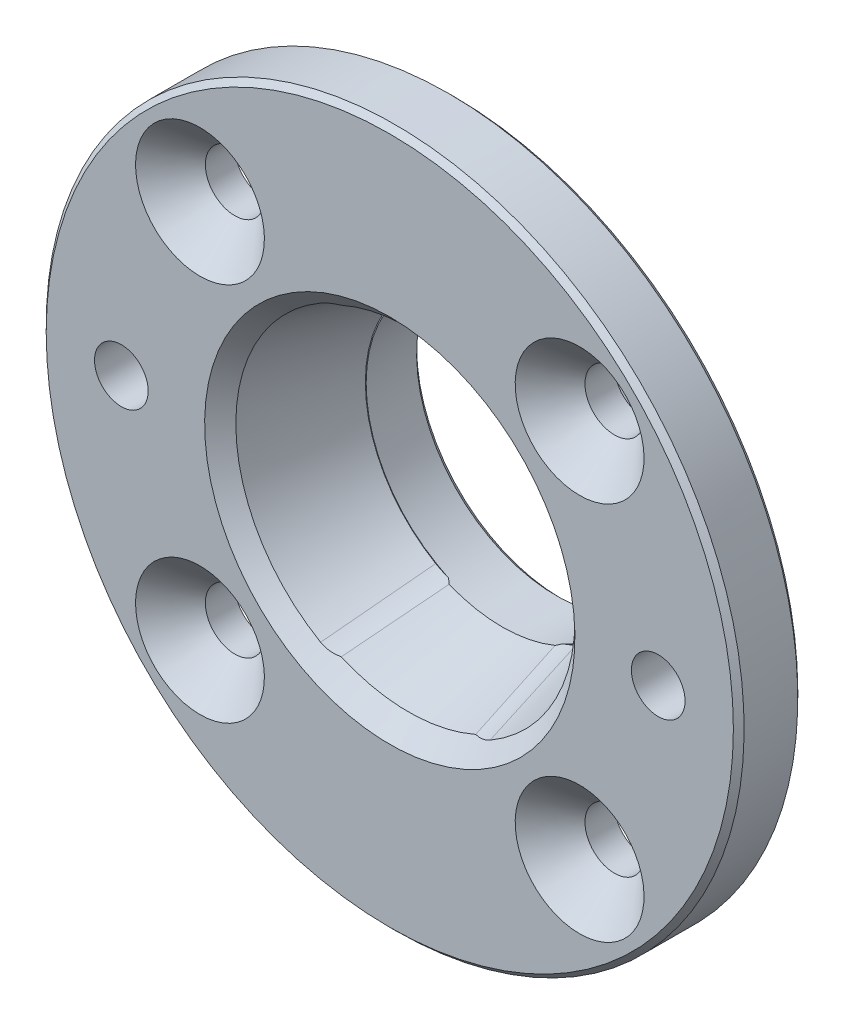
ISO-10303-21;
HEADER;
FILE_DESCRIPTION(('STEP AP214'),'2;1');
FILE_NAME('part.step','',(''),(''),'','','');
FILE_SCHEMA(('AUTOMOTIVE_DESIGN { 1 0 10303 214 1 1 1 1 }'));
ENDSEC;
DATA;
#1=APPLICATION_CONTEXT('core data for automotive mechanical design processes');
#2=APPLICATION_PROTOCOL_DEFINITION('international standard','automotive_design',2000,#1);
#3=PRODUCT_CONTEXT('',#1,'mechanical');
#4=PRODUCT('Part','Part','',(#3));
#5=PRODUCT_RELATED_PRODUCT_CATEGORY('part','',(#4));
#6=PRODUCT_DEFINITION_FORMATION('','',#4);
#7=PRODUCT_DEFINITION_CONTEXT('part definition',#1,'design');
#8=PRODUCT_DEFINITION('design','',#6,#7);
#9=PRODUCT_DEFINITION_SHAPE('','',#8);
#10=(LENGTH_UNIT() NAMED_UNIT(*) SI_UNIT(.MILLI.,.METRE.));
#11=(NAMED_UNIT(*) PLANE_ANGLE_UNIT() SI_UNIT($,.RADIAN.));
#12=(NAMED_UNIT(*) SI_UNIT($,.STERADIAN.) SOLID_ANGLE_UNIT());
#13=UNCERTAINTY_MEASURE_WITH_UNIT(LENGTH_MEASURE(1.E-05),#10,'distance_accuracy_value','');
#14=(GEOMETRIC_REPRESENTATION_CONTEXT(3) GLOBAL_UNCERTAINTY_ASSIGNED_CONTEXT((#13)) GLOBAL_UNIT_ASSIGNED_CONTEXT((#10,
#11,#12)) REPRESENTATION_CONTEXT('',''));
#15=CARTESIAN_POINT('',(0.,0.,0.));
#16=DIRECTION('',(0.,0.,1.));
#17=DIRECTION('',(1.,0.,0.));
#18=AXIS2_PLACEMENT_3D('',#15,#16,#17);
#19=CARTESIAN_POINT('',(0.,0.,-10.4622433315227));
#20=DIRECTION('',(0.,0.,1.));
#21=DIRECTION('',(0.,-1.,0.));
#22=AXIS2_PLACEMENT_3D('',#19,#20,#21);
#23=CONICAL_SURFACE('',#22,13.,0.279252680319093);
#24=CARTESIAN_POINT('',(0.,0.,-1.74370722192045));
#25=DIRECTION('',(0.,0.,-1.));
#26=DIRECTION('',(0.,1.,0.));
#27=AXIS2_PLACEMENT_3D('',#24,#25,#26);
#28=CIRCLE('',#27,15.5);
#29=CARTESIAN_POINT('',(-6.26010622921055,14.1796004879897,-1.7437072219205));
#30=VERTEX_POINT('',#29);
#31=CARTESIAN_POINT('',(6.26010622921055,14.1796004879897,-1.7437072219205));
#32=VERTEX_POINT('',#31);
#33=EDGE_CURVE('E105',#30,#32,#28,.T.);
#34=ORIENTED_EDGE('',*,*,#33,.F.);
#35=CARTESIAN_POINT('',(-4.9349323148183,12.0268429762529,-10.4624433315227));
#36=CARTESIAN_POINT('',(-5.18181992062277,12.4215140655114,-8.8621019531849));
#37=CARTESIAN_POINT('',(-5.42636777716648,12.8165502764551,-7.26149286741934));
#38=CARTESIAN_POINT('',(-5.91198676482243,13.6071862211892,-4.05989042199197));
#39=CARTESIAN_POINT('',(-6.15305790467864,14.0027859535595,-2.45889706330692));
#40=CARTESIAN_POINT('',(-6.73149209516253,14.9569775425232,1.40106462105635));
#41=CARTESIAN_POINT('',(-7.06772975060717,15.5157668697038,3.66015237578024));
#42=CARTESIAN_POINT('',(-7.73716226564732,16.6339063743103,8.17864877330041));
#43=CARTESIAN_POINT('',(-8.07035711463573,17.1932565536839,10.4380574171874));
#44=CARTESIAN_POINT('',(-8.40276975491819,17.7527687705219,12.6975390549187));
#45=B_SPLINE_CURVE_WITH_KNOTS('',3,(#35,#36,#37,#38,#39,#40,#41,#42,#43,#44),.UNSPECIFIED.,.F.,
.F.,(4,2,2,2,4),(0.,5.00002407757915,10.0000355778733,17.0540398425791,24.1080686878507),.UNSPECIFIED.);
#46=CARTESIAN_POINT('',(-4.93496318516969,12.0268922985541,-10.4622433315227));
#47=VERTEX_POINT('',#46);
#48=EDGE_CURVE('E247',#47,#30,#45,.T.);
#49=ORIENTED_EDGE('',*,*,#48,.F.);
#50=CARTESIAN_POINT('',(0.,0.,-10.4622433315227));
#51=DIRECTION('',(0.,0.,1.));
#52=DIRECTION('',(0.,-1.,0.));
#53=AXIS2_PLACEMENT_3D('',#50,#51,#52);
#54=CIRCLE('',#53,13.);
#55=CARTESIAN_POINT('',(4.93496318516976,12.026892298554,-10.4622433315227));
#56=VERTEX_POINT('',#55);
#57=EDGE_CURVE('E126',#56,#47,#54,.T.);
#58=ORIENTED_EDGE('',*,*,#57,.F.);
#59=CARTESIAN_POINT('',(6.52145457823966,14.6106969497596,0.000199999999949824));
#60=CARTESIAN_POINT('',(6.39599143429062,14.4033474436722,-0.838457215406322));
#61=CARTESIAN_POINT('',(6.27023017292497,14.1960504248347,-1.67708266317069));
#62=CARTESIAN_POINT('',(6.01797286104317,13.7815811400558,-3.354254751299));
#63=CARTESIAN_POINT('',(5.89147680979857,13.5744088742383,-4.19280139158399));
#64=CARTESIAN_POINT('',(5.51067998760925,12.9531110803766,-6.70829126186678));
#65=CARTESIAN_POINT('',(5.25506958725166,12.539202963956,-8.38509087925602));
#66=CARTESIAN_POINT('',(4.97616295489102,12.0927505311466,-10.1951998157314));
#67=CARTESIAN_POINT('',(4.95555647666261,12.0597954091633,-10.3288226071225));
#68=CARTESIAN_POINT('',(4.9349323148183,12.0268429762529,-10.4624433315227));
#69=B_SPLINE_CURVE_WITH_KNOTS('',3,(#59,#60,#61,#62,#63,#64,#65,#66,#67,#68),.UNSPECIFIED.,.F.,
.F.,(4,2,2,2,4),(0.,2.61891668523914,5.23783596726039,10.4756544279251,10.8931367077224),.UNSPECIFIED.);
#70=EDGE_CURVE('E119',#32,#56,#69,.T.);
#71=ORIENTED_EDGE('',*,*,#70,.F.);
#72=EDGE_LOOP('',(#34,#49,#58,#71));
#73=FACE_BOUND('',#72,.T.);
#74=ADVANCED_FACE('F15',(#73),#23,.F.);
#75=CARTESIAN_POINT('',(0.,0.,0.));
#76=DIRECTION('',(0.,0.,1.));
#77=DIRECTION('',(0.,-1.,0.));
#78=AXIS2_PLACEMENT_3D('',#75,#76,#77);
#79=CYLINDRICAL_SURFACE('',#78,13.);
#80=CARTESIAN_POINT('',(0.,0.,-7.0713120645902));
#81=DIRECTION('',(0.137818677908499,0.238708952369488,-0.96126169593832));
#82=DIRECTION('',(0.480630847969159,0.832477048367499,0.275637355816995));
#83=AXIS2_PLACEMENT_3D('',#80,#81,#82);
#84=ELLIPSE('',#83,13.5238926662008,13.);
#85=CARTESIAN_POINT('',(-5.32496767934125,-11.8593726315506,-10.7797906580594));
#86=VERTEX_POINT('',#85);
#87=CARTESIAN_POINT('',(-6.5,-11.2583302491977,-10.7990020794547));
#88=VERTEX_POINT('',#87);
#89=EDGE_CURVE('E325',#86,#88,#84,.T.);
#90=ORIENTED_EDGE('',*,*,#89,.F.);
#91=CARTESIAN_POINT('',(-4.93496318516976,-12.0268922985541,-10.4622433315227));
#92=CARTESIAN_POINT('',(-4.96588297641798,-12.0142048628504,-10.4912392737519));
#93=CARTESIAN_POINT('',(-4.99720468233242,-12.0012135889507,-10.5196788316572));
#94=CARTESIAN_POINT('',(-5.0606060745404,-11.9746167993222,-10.5752970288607));
#95=CARTESIAN_POINT('',(-5.09268459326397,-11.9610122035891,-10.6024774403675));
#96=CARTESIAN_POINT('',(-5.1576449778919,-11.9331448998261,-10.6555151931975));
#97=CARTESIAN_POINT('',(-5.19052687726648,-11.9188821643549,-10.6813724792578));
#98=CARTESIAN_POINT('',(-5.25713048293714,-11.8896552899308,-10.7316795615));
#99=CARTESIAN_POINT('',(-5.29085334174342,-11.8746901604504,-10.7561272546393));
#100=CARTESIAN_POINT('',(-5.32496767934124,-11.8593726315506,-10.7797906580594));
#101=B_SPLINE_CURVE_WITH_KNOTS('',3,(#91,#92,#93,#94,#95,#96,#97,#98,#99,#100),.UNSPECIFIED.,
.F.,.F.,(4,2,2,2,4),(0.,0.132738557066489,0.265284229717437,0.397835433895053,
0.530579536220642),.UNSPECIFIED.);
#102=CARTESIAN_POINT('',(-4.93496318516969,-12.0268922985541,-10.4622433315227));
#103=VERTEX_POINT('',#102);
#104=EDGE_CURVE('E790',#103,#86,#101,.T.);
#105=ORIENTED_EDGE('',*,*,#104,.F.);
#106=CARTESIAN_POINT('',(4.93496318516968,-12.0268922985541,-10.4622433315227));
#107=VERTEX_POINT('',#106);
#108=EDGE_CURVE('E330',#103,#107,#54,.T.);
#109=ORIENTED_EDGE('',*,*,#108,.T.);
#110=CARTESIAN_POINT('',(5.32496767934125,-11.8593726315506,-10.7797906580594));
#111=CARTESIAN_POINT('',(5.29085334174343,-11.8746901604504,-10.7561272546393));
#112=CARTESIAN_POINT('',(5.25713048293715,-11.8896552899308,-10.7316795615));
#113=CARTESIAN_POINT('',(5.19052687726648,-11.9188821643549,-10.6813724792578));
#114=CARTESIAN_POINT('',(5.1576449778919,-11.9331448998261,-10.6555151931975));
#115=CARTESIAN_POINT('',(5.09268459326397,-11.9610122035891,-10.6024774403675));
#116=CARTESIAN_POINT('',(5.0606060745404,-11.9746167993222,-10.5752970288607));
#117=CARTESIAN_POINT('',(4.99720468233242,-12.0012135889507,-10.5196788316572));
#118=CARTESIAN_POINT('',(4.96588297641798,-12.0142048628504,-10.4912392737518));
#119=CARTESIAN_POINT('',(4.93496318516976,-12.0268922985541,-10.4622433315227));
#120=B_SPLINE_CURVE_WITH_KNOTS('',3,(#110,#111,#112,#113,#114,#115,#116,#117,#118,#119),
.UNSPECIFIED.,.F.,.F.,(4,2,2,2,4),(0.,0.132744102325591,0.265295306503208,0.397840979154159,
0.53057953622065),.UNSPECIFIED.);
#121=CARTESIAN_POINT('',(5.32496767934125,-11.8593726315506,-10.7797906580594));
#122=VERTEX_POINT('',#121);
#123=EDGE_CURVE('E220',#122,#107,#120,.T.);
#124=ORIENTED_EDGE('',*,*,#123,.F.);
#125=CARTESIAN_POINT('',(0.,0.,-7.0713120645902));
#126=DIRECTION('',(-0.137818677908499,0.238708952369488,-0.96126169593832));
#127=DIRECTION('',(-0.480630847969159,0.832477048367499,0.275637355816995));
#128=AXIS2_PLACEMENT_3D('',#125,#126,#127);
#129=ELLIPSE('',#128,13.5238926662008,13.);
#130=CARTESIAN_POINT('',(6.5,-11.2583302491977,-10.7990020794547));
#131=VERTEX_POINT('',#130);
#132=EDGE_CURVE('E132',#131,#122,#129,.T.);
#133=ORIENTED_EDGE('',*,*,#132,.F.);
#134=CARTESIAN_POINT('',(0.,0.,-10.7990020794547));
#135=DIRECTION('',(0.,0.,-1.));
#136=DIRECTION('',(0.,1.,0.));
#137=AXIS2_PLACEMENT_3D('',#134,#135,#136);
#138=CIRCLE('',#137,13.);
#139=CARTESIAN_POINT('',(6.5,11.2583302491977,-10.7990020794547));
#140=VERTEX_POINT('',#139);
#141=EDGE_CURVE('E359',#131,#140,#138,.F.);
#142=ORIENTED_EDGE('',*,*,#141,.T.);
#143=CARTESIAN_POINT('',(0.,0.,-7.0713120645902));
#144=DIRECTION('',(-0.137818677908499,-0.238708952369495,-0.961261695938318));
#145=DIRECTION('',(-0.480630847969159,-0.832477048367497,0.275637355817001));
#146=AXIS2_PLACEMENT_3D('',#143,#144,#145);
#147=ELLIPSE('',#146,13.5238926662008,13.);
#148=CARTESIAN_POINT('',(5.32496767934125,11.8593726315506,-10.7797906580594));
#149=VERTEX_POINT('',#148);
#150=EDGE_CURVE('E130',#149,#140,#147,.T.);
#151=ORIENTED_EDGE('',*,*,#150,.F.);
#152=CARTESIAN_POINT('',(4.93496318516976,12.026892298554,-10.4622433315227));
#153=CARTESIAN_POINT('',(4.96588297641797,12.0142048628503,-10.4912392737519));
#154=CARTESIAN_POINT('',(4.99720468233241,12.0012135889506,-10.5196788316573));
#155=CARTESIAN_POINT('',(5.0606060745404,11.9746167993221,-10.5752970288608));
#156=CARTESIAN_POINT('',(5.09268459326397,11.961012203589,-10.6024774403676));
#157=CARTESIAN_POINT('',(5.1576449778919,11.933144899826,-10.6555151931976));
#158=CARTESIAN_POINT('',(5.19052687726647,11.9188821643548,-10.6813724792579));
#159=CARTESIAN_POINT('',(5.25713048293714,11.8896552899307,-10.7316795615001));
#160=CARTESIAN_POINT('',(5.29085334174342,11.8746901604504,-10.7561272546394));
#161=CARTESIAN_POINT('',(5.32496767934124,11.8593726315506,-10.7797906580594));
#162=B_SPLINE_CURVE_WITH_KNOTS('',3,(#152,#153,#154,#155,#156,#157,#158,#159,#160,#161),
.UNSPECIFIED.,.F.,.F.,(4,2,2,2,4),(0.,0.132738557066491,0.26528422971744,0.397835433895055,
0.530579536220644),.UNSPECIFIED.);
#163=EDGE_CURVE('E127',#56,#149,#162,.T.);
#164=ORIENTED_EDGE('',*,*,#163,.F.);
#165=ORIENTED_EDGE('',*,*,#57,.T.);
#166=CARTESIAN_POINT('',(-5.32496767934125,11.8593726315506,-10.7797906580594));
#167=CARTESIAN_POINT('',(-5.29085334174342,11.8746901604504,-10.7561272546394));
#168=CARTESIAN_POINT('',(-5.25713048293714,11.8896552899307,-10.7316795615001));
#169=CARTESIAN_POINT('',(-5.19052687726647,11.9188821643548,-10.6813724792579));
#170=CARTESIAN_POINT('',(-5.1576449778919,11.933144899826,-10.6555151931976));
#171=CARTESIAN_POINT('',(-5.09268459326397,11.961012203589,-10.6024774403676));
#172=CARTESIAN_POINT('',(-5.0606060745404,11.9746167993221,-10.5752970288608));
#173=CARTESIAN_POINT('',(-4.99720468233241,12.0012135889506,-10.5196788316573));
#174=CARTESIAN_POINT('',(-4.96588297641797,12.0142048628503,-10.4912392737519));
#175=CARTESIAN_POINT('',(-4.93496318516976,12.026892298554,-10.4622433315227));
#176=B_SPLINE_CURVE_WITH_KNOTS('',3,(#166,#167,#168,#169,#170,#171,#172,#173,#174,#175),
.UNSPECIFIED.,.F.,.F.,(4,2,2,2,4),(0.,0.132744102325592,0.26529530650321,0.39784097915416,
0.530579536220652),.UNSPECIFIED.);
#177=CARTESIAN_POINT('',(-5.32496767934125,11.8593726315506,-10.7797906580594));
#178=VERTEX_POINT('',#177);
#179=EDGE_CURVE('E239',#178,#47,#176,.T.);
#180=ORIENTED_EDGE('',*,*,#179,.F.);
#181=CARTESIAN_POINT('',(0.,0.,-7.0713120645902));
#182=DIRECTION('',(0.137818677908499,-0.238708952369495,-0.961261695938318));
#183=DIRECTION('',(0.480630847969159,-0.832477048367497,0.275637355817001));
#184=AXIS2_PLACEMENT_3D('',#181,#182,#183);
#185=ELLIPSE('',#184,13.5238926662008,13.);
#186=CARTESIAN_POINT('',(-6.5,11.2583302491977,-10.7990020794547));
#187=VERTEX_POINT('',#186);
#188=EDGE_CURVE('E246',#187,#178,#185,.T.);
#189=ORIENTED_EDGE('',*,*,#188,.F.);
#190=CARTESIAN_POINT('',(0.,0.,-10.7990020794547));
#191=DIRECTION('',(0.,0.,-1.));
#192=DIRECTION('',(0.,1.,0.));
#193=AXIS2_PLACEMENT_3D('',#190,#191,#192);
#194=CIRCLE('',#193,13.);
#195=EDGE_CURVE('E361',#187,#88,#194,.F.);
#196=ORIENTED_EDGE('',*,*,#195,.T.);
#197=EDGE_LOOP('',(#90,#105,#109,#124,#133,#142,#151,#164,#165,#180,#189,#196));
#198=FACE_BOUND('',#197,.T.);
#199=CARTESIAN_POINT('',(0.,0.,-15.5));
#200=DIRECTION('',(0.,0.,-1.));
#201=DIRECTION('',(0.,1.,0.));
#202=AXIS2_PLACEMENT_3D('',#199,#200,#201);
#203=CIRCLE('',#202,13.);
#204=CARTESIAN_POINT('',(0.,12.9999999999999,-15.5));
#205=VERTEX_POINT('',#204);
#206=EDGE_CURVE('E350',#205,#205,#203,.T.);
#207=ORIENTED_EDGE('',*,*,#206,.T.);
#208=EDGE_LOOP('',(#207));
#209=FACE_BOUND('',#208,.T.);
#210=ADVANCED_FACE('F226',(#198,#209),#79,.F.);
#211=CARTESIAN_POINT('',(16.,0.,0.));
#212=DIRECTION('',(0.,0.,1.));
#213=DIRECTION('',(0.,-1.,0.));
#214=AXIS2_PLACEMENT_3D('',#211,#212,#213);
#215=PLANE('',#214);
#216=CARTESIAN_POINT('',(25.,0.,0.));
#217=DIRECTION('',(0.,0.,1.));
#218=DIRECTION('',(1.,0.,0.));
#219=AXIS2_PLACEMENT_3D('',#216,#217,#218);
#220=CIRCLE('',#219,2.5);
#221=CARTESIAN_POINT('',(27.5,0.,0.));
#222=VERTEX_POINT('',#221);
#223=EDGE_CURVE('E779',#222,#222,#220,.T.);
#224=ORIENTED_EDGE('',*,*,#223,.F.);
#225=EDGE_LOOP('',(#224));
#226=FACE_BOUND('',#225,.T.);
#227=CARTESIAN_POINT('',(-25.,0.,0.));
#228=DIRECTION('',(0.,0.,1.));
#229=DIRECTION('',(1.,0.,0.));
#230=AXIS2_PLACEMENT_3D('',#227,#228,#229);
#231=CIRCLE('',#230,2.5);
#232=CARTESIAN_POINT('',(-22.5,0.,0.));
#233=VERTEX_POINT('',#232);
#234=EDGE_CURVE('E780',#233,#233,#231,.T.);
#235=ORIENTED_EDGE('',*,*,#234,.F.);
#236=EDGE_LOOP('',(#235));
#237=FACE_BOUND('',#236,.T.);
#238=CARTESIAN_POINT('',(0.,0.,0.));
#239=DIRECTION('',(0.,0.,-1.));
#240=DIRECTION('',(0.,1.,0.));
#241=AXIS2_PLACEMENT_3D('',#238,#239,#240);
#242=CIRCLE('',#241,17.2437072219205);
#243=CARTESIAN_POINT('',(0.,17.2437072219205,0.));
#244=VERTEX_POINT('',#243);
#245=EDGE_CURVE('E295',#244,#244,#242,.T.);
#246=ORIENTED_EDGE('',*,*,#245,.T.);
#247=EDGE_LOOP('',(#246));
#248=FACE_BOUND('',#247,.T.);
#249=CARTESIAN_POINT('',(0.,0.,0.));
#250=DIRECTION('',(0.,0.,1.));
#251=DIRECTION('',(0.,-1.,0.));
#252=AXIS2_PLACEMENT_3D('',#249,#250,#251);
#253=CIRCLE('',#252,32.);
#254=CARTESIAN_POINT('',(0.,-32.,1.1172740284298E-13));
#255=VERTEX_POINT('',#254);
#256=EDGE_CURVE('E353',#255,#255,#253,.T.);
#257=ORIENTED_EDGE('',*,*,#256,.T.);
#258=EDGE_LOOP('',(#257));
#259=FACE_BOUND('',#258,.T.);
#260=CARTESIAN_POINT('',(17.6776695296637,17.6776695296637,0.));
#261=DIRECTION('',(0.,0.,1.));
#262=DIRECTION('',(0.,-1.,0.));
#263=AXIS2_PLACEMENT_3D('',#260,#261,#262);
#264=CIRCLE('',#263,6.);
#265=CARTESIAN_POINT('',(17.6776695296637,11.6776695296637,0.));
#266=VERTEX_POINT('',#265);
#267=EDGE_CURVE('E459',#266,#266,#264,.T.);
#268=ORIENTED_EDGE('',*,*,#267,.F.);
#269=EDGE_LOOP('',(#268));
#270=FACE_BOUND('',#269,.T.);
#271=CARTESIAN_POINT('',(17.6776695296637,-17.6776695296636,0.));
#272=DIRECTION('',(0.,0.,1.));
#273=DIRECTION('',(0.,-1.,0.));
#274=AXIS2_PLACEMENT_3D('',#271,#272,#273);
#275=CIRCLE('',#274,6.);
#276=CARTESIAN_POINT('',(17.6776695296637,-23.6776695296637,0.));
#277=VERTEX_POINT('',#276);
#278=EDGE_CURVE('E453',#277,#277,#275,.T.);
#279=ORIENTED_EDGE('',*,*,#278,.F.);
#280=EDGE_LOOP('',(#279));
#281=FACE_BOUND('',#280,.T.);
#282=CARTESIAN_POINT('',(-17.6776695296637,-17.6776695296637,0.));
#283=DIRECTION('',(0.,0.,1.));
#284=DIRECTION('',(0.,-1.,0.));
#285=AXIS2_PLACEMENT_3D('',#282,#283,#284);
#286=CIRCLE('',#285,6.);
#287=CARTESIAN_POINT('',(-17.6776695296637,-23.6776695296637,0.));
#288=VERTEX_POINT('',#287);
#289=EDGE_CURVE('E447',#288,#288,#286,.T.);
#290=ORIENTED_EDGE('',*,*,#289,.F.);
#291=EDGE_LOOP('',(#290));
#292=FACE_BOUND('',#291,.T.);
#293=CARTESIAN_POINT('',(-17.6776695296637,17.6776695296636,0.));
#294=DIRECTION('',(0.,0.,1.));
#295=DIRECTION('',(0.,-1.,0.));
#296=AXIS2_PLACEMENT_3D('',#293,#294,#295);
#297=CIRCLE('',#296,6.);
#298=CARTESIAN_POINT('',(-17.6776695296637,11.6776695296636,0.));
#299=VERTEX_POINT('',#298);
#300=EDGE_CURVE('E441',#299,#299,#297,.T.);
#301=ORIENTED_EDGE('',*,*,#300,.F.);
#302=EDGE_LOOP('',(#301));
#303=FACE_BOUND('',#302,.T.);
#304=ADVANCED_FACE('F230',(#226,#237,#248,#259,#270,#281,#292,#303),#215,.T.);
#305=CARTESIAN_POINT('',(6.26010622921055,-14.1796004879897,-1.74370722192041));
#306=VERTEX_POINT('',#305);
#307=CARTESIAN_POINT('',(-6.26010622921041,-14.1796004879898,-1.74370722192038));
#308=VERTEX_POINT('',#307);
#309=EDGE_CURVE('E31',#306,#308,#28,.T.);
#310=ORIENTED_EDGE('',*,*,#309,.F.);
#311=CARTESIAN_POINT('',(4.9349323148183,-12.026842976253,-10.4624433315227));
#312=CARTESIAN_POINT('',(5.06945387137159,-12.2417968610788,-9.59081748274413));
#313=CARTESIAN_POINT('',(5.20323292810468,-12.4568641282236,-8.71910542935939));
#314=CARTESIAN_POINT('',(5.46956425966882,-12.8871916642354,-6.97554270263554));
#315=CARTESIAN_POINT('',(5.60211653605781,-13.1024519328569,-6.10369202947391));
#316=CARTESIAN_POINT('',(5.86625280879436,-13.5331321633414,-4.35988400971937));
#317=CARTESIAN_POINT('',(5.99783680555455,-13.7485521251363,-3.48792666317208));
#318=CARTESIAN_POINT('',(6.26020425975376,-14.1795283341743,-1.74392399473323));
#319=CARTESIAN_POINT('',(6.39098771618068,-14.3950845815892,-0.871878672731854));
#320=CARTESIAN_POINT('',(6.52145457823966,-14.6106969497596,0.000200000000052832));
#321=B_SPLINE_CURVE_WITH_KNOTS('',3,(#311,#312,#313,#314,#315,#316,#317,#318,#319,#320),
.UNSPECIFIED.,.F.,.F.,(4,2,2,2,4),(0.,2.72328673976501,5.44657002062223,8.16985214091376,
10.8931377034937),.UNSPECIFIED.);
#322=EDGE_CURVE('E213',#107,#306,#321,.T.);
#323=ORIENTED_EDGE('',*,*,#322,.F.);
#324=ORIENTED_EDGE('',*,*,#108,.F.);
#325=CARTESIAN_POINT('',(-3.40784477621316,-9.66500434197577,-20.0588913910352));
#326=CARTESIAN_POINT('',(-3.5404379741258,-9.86116786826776,-19.2598790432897));
#327=CARTESIAN_POINT('',(-3.67121565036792,-10.0575376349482,-18.4606193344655));
#328=CARTESIAN_POINT('',(-3.92990164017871,-10.4506239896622,-16.8617244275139));
#329=CARTESIAN_POINT('',(-4.05780996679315,-10.6473405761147,-16.0620892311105));
#330=CARTESIAN_POINT('',(-4.31151858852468,-11.0410543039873,-14.4625650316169));
#331=CARTESIAN_POINT('',(-4.43731890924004,-11.2380514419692,-13.6626760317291));
#332=CARTESIAN_POINT('',(-4.68727087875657,-11.6322809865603,-12.0626974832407));
#333=CARTESIAN_POINT('',(-4.81142252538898,-11.8295133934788,-11.2626079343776));
#334=CARTESIAN_POINT('',(-5.18194984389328,-12.4214988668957,-8.86212740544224));
#335=CARTESIAN_POINT('',(-5.42639998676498,-12.8165434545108,-7.26151126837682));
#336=CARTESIAN_POINT('',(-5.91195046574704,-13.6071863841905,-4.05989898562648));
#337=CARTESIAN_POINT('',(-6.15305078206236,-14.0027847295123,-2.45890283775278));
#338=CARTESIAN_POINT('',(-6.73150335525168,-14.9569812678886,1.40108085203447));
#339=CARTESIAN_POINT('',(-7.06770835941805,-15.5157795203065,3.66019078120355));
#340=CARTESIAN_POINT('',(-7.56982370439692,-16.3543799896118,7.04906534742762));
#341=CARTESIAN_POINT('',(-7.73682914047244,-16.6339789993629,8.17871843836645));
#342=CARTESIAN_POINT('',(-8.07022845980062,-17.1932923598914,10.4380858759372));
#343=CARTESIAN_POINT('',(-8.23662234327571,-17.4730067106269,11.5678002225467));
#344=CARTESIAN_POINT('',(-8.40276975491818,-17.7527687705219,12.6975390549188));
#345=B_SPLINE_CURVE_WITH_KNOTS('',3,(#325,#326,#327,#328,#329,#330,#331,#332,#333,#334,#335,
#336,#337,#338,#339,#340,#341,#342,#343,#344),.UNSPECIFIED.,.F.,.F.,(4,2,2,2,2,2,2,2,2,4),(0.,
2.50006071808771,5.00011006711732,7.5001290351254,10.0001512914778,15.0001543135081,
20.0001868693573,27.0542460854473,30.5812337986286,34.1082202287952),.UNSPECIFIED.);
#346=EDGE_CURVE('E294',#308,#103,#345,.F.);
#347=ORIENTED_EDGE('',*,*,#346,.F.);
#348=EDGE_LOOP('',(#310,#323,#324,#347));
#349=FACE_BOUND('',#348,.T.);
#350=ADVANCED_FACE('F147',(#349),#23,.F.);
#351=CARTESIAN_POINT('',(13.,0.,-16.));
#352=DIRECTION('',(0.,0.,-1.));
#353=DIRECTION('',(0.,1.,0.));
#354=AXIS2_PLACEMENT_3D('',#351,#352,#353);
#355=PLANE('',#354);
#356=CARTESIAN_POINT('',(0.,0.,-16.));
#357=DIRECTION('',(0.,0.,-1.));
#358=DIRECTION('',(0.,1.,0.));
#359=AXIS2_PLACEMENT_3D('',#356,#357,#358);
#360=CIRCLE('',#359,13.5);
#361=CARTESIAN_POINT('',(0.,13.4999999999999,-16.));
#362=VERTEX_POINT('',#361);
#363=EDGE_CURVE('E347',#362,#362,#360,.F.);
#364=ORIENTED_EDGE('',*,*,#363,.T.);
#365=EDGE_LOOP('',(#364));
#366=FACE_BOUND('',#365,.T.);
#367=CARTESIAN_POINT('',(0.,0.,-16.));
#368=DIRECTION('',(0.,0.,-1.));
#369=DIRECTION('',(0.,1.,0.));
#370=AXIS2_PLACEMENT_3D('',#367,#368,#369);
#371=CIRCLE('',#370,17.4);
#372=CARTESIAN_POINT('',(0.,17.3999999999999,-16.0000000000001));
#373=VERTEX_POINT('',#372);
#374=EDGE_CURVE('E344',#373,#373,#371,.T.);
#375=ORIENTED_EDGE('',*,*,#374,.T.);
#376=EDGE_LOOP('',(#375));
#377=FACE_BOUND('',#376,.T.);
#378=ADVANCED_FACE('F232',(#366,#377),#355,.T.);
#379=CARTESIAN_POINT('',(0.,0.,0.));
#380=DIRECTION('',(0.,0.,1.));
#381=DIRECTION('',(0.,-1.,0.));
#382=AXIS2_PLACEMENT_3D('',#379,#380,#381);
#383=CYLINDRICAL_SURFACE('',#382,18.);
#384=CARTESIAN_POINT('',(0.,0.,-8.));
#385=DIRECTION('',(0.,0.,1.));
#386=DIRECTION('',(0.,-1.,0.));
#387=AXIS2_PLACEMENT_3D('',#384,#385,#386);
#388=CIRCLE('',#387,18.);
#389=CARTESIAN_POINT('',(0.,-18.,-7.99999999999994));
#390=VERTEX_POINT('',#389);
#391=EDGE_CURVE('E421',#390,#390,#388,.T.);
#392=ORIENTED_EDGE('',*,*,#391,.F.);
#393=EDGE_LOOP('',(#392));
#394=FACE_BOUND('',#393,.T.);
#395=CARTESIAN_POINT('',(0.,0.,-12.9));
#396=DIRECTION('',(0.,0.,1.));
#397=DIRECTION('',(0.,-1.,0.));
#398=AXIS2_PLACEMENT_3D('',#395,#396,#397);
#399=CIRCLE('',#398,18.);
#400=CARTESIAN_POINT('',(0.,-18.,-12.8999999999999));
#401=VERTEX_POINT('',#400);
#402=EDGE_CURVE('E335',#401,#401,#399,.T.);
#403=ORIENTED_EDGE('',*,*,#402,.T.);
#404=EDGE_LOOP('',(#403));
#405=FACE_BOUND('',#404,.T.);
#406=ADVANCED_FACE('F286',(#394,#405),#383,.T.);
#407=CARTESIAN_POINT('',(18.,0.,-6.));
#408=DIRECTION('',(0.,0.,-1.));
#409=DIRECTION('',(0.,1.,0.));
#410=AXIS2_PLACEMENT_3D('',#407,#408,#409);
#411=PLANE('',#410);
#412=CARTESIAN_POINT('',(17.6776695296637,17.6776695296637,-6.));
#413=DIRECTION('',(0.,0.,-1.));
#414=DIRECTION('',(0.,1.,0.));
#415=AXIS2_PLACEMENT_3D('',#412,#413,#414);
#416=CIRCLE('',#415,2.75);
#417=CARTESIAN_POINT('',(17.6776695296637,20.4276695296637,-6.00000000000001));
#418=VERTEX_POINT('',#417);
#419=EDGE_CURVE('E10',#418,#418,#416,.T.);
#420=ORIENTED_EDGE('',*,*,#419,.F.);
#421=EDGE_LOOP('',(#420));
#422=FACE_BOUND('',#421,.T.);
#423=CARTESIAN_POINT('',(17.6776695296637,-17.6776695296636,-6.));
#424=DIRECTION('',(0.,0.,-1.));
#425=DIRECTION('',(0.,1.,0.));
#426=AXIS2_PLACEMENT_3D('',#423,#424,#425);
#427=CIRCLE('',#426,2.75);
#428=CARTESIAN_POINT('',(17.6776695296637,-14.9276695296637,-6.00000000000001));
#429=VERTEX_POINT('',#428);
#430=EDGE_CURVE('E24',#429,#429,#427,.T.);
#431=ORIENTED_EDGE('',*,*,#430,.F.);
#432=EDGE_LOOP('',(#431));
#433=FACE_BOUND('',#432,.T.);
#434=CARTESIAN_POINT('',(-17.6776695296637,-17.6776695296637,-6.));
#435=DIRECTION('',(0.,0.,-1.));
#436=DIRECTION('',(0.,1.,0.));
#437=AXIS2_PLACEMENT_3D('',#434,#435,#436);
#438=CIRCLE('',#437,2.75);
#439=CARTESIAN_POINT('',(-17.6776695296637,-14.9276695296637,-6.00000000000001));
#440=VERTEX_POINT('',#439);
#441=EDGE_CURVE('E365',#440,#440,#438,.T.);
#442=ORIENTED_EDGE('',*,*,#441,.F.);
#443=EDGE_LOOP('',(#442));
#444=FACE_BOUND('',#443,.T.);
#445=CARTESIAN_POINT('',(-17.6776695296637,17.6776695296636,-6.));
#446=DIRECTION('',(0.,0.,-1.));
#447=DIRECTION('',(0.,1.,0.));
#448=AXIS2_PLACEMENT_3D('',#445,#446,#447);
#449=CIRCLE('',#448,2.75);
#450=CARTESIAN_POINT('',(-17.6776695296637,20.4276695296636,-6.00000000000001));
#451=VERTEX_POINT('',#450);
#452=EDGE_CURVE('E362',#451,#451,#449,.T.);
#453=ORIENTED_EDGE('',*,*,#452,.F.);
#454=EDGE_LOOP('',(#453));
#455=FACE_BOUND('',#454,.T.);
#456=CARTESIAN_POINT('',(25.,0.,-6.));
#457=DIRECTION('',(0.,0.,-1.));
#458=DIRECTION('',(0.,1.,0.));
#459=AXIS2_PLACEMENT_3D('',#456,#457,#458);
#460=CIRCLE('',#459,2.5);
#461=CARTESIAN_POINT('',(25.,2.50000000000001,-6.00000000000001));
#462=VERTEX_POINT('',#461);
#463=EDGE_CURVE('E115',#462,#462,#460,.T.);
#464=ORIENTED_EDGE('',*,*,#463,.F.);
#465=EDGE_LOOP('',(#464));
#466=FACE_BOUND('',#465,.T.);
#467=CARTESIAN_POINT('',(-25.,0.,-6.));
#468=DIRECTION('',(0.,0.,-1.));
#469=DIRECTION('',(0.,1.,0.));
#470=AXIS2_PLACEMENT_3D('',#467,#468,#469);
#471=CIRCLE('',#470,2.5);
#472=CARTESIAN_POINT('',(-25.,2.5,-6.00000000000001));
#473=VERTEX_POINT('',#472);
#474=EDGE_CURVE('E393',#473,#473,#471,.T.);
#475=ORIENTED_EDGE('',*,*,#474,.F.);
#476=EDGE_LOOP('',(#475));
#477=FACE_BOUND('',#476,.T.);
#478=CARTESIAN_POINT('',(0.,0.,-6.));
#479=DIRECTION('',(0.,0.,1.));
#480=DIRECTION('',(0.,-1.,0.));
#481=AXIS2_PLACEMENT_3D('',#478,#479,#480);
#482=CIRCLE('',#481,19.);
#483=CARTESIAN_POINT('',(0.,-19.,-5.99999999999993));
#484=VERTEX_POINT('',#483);
#485=EDGE_CURVE('E397',#484,#484,#482,.T.);
#486=ORIENTED_EDGE('',*,*,#485,.T.);
#487=EDGE_LOOP('',(#486));
#488=FACE_BOUND('',#487,.T.);
#489=CARTESIAN_POINT('',(0.,0.,-6.));
#490=DIRECTION('',(0.,0.,-1.));
#491=DIRECTION('',(0.,1.,0.));
#492=AXIS2_PLACEMENT_3D('',#489,#490,#491);
#493=CIRCLE('',#492,32.);
#494=CARTESIAN_POINT('',(0.,32.,-6.00000000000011));
#495=VERTEX_POINT('',#494);
#496=EDGE_CURVE('E333',#495,#495,#493,.T.);
#497=ORIENTED_EDGE('',*,*,#496,.T.);
#498=EDGE_LOOP('',(#497));
#499=FACE_BOUND('',#498,.T.);
#500=ADVANCED_FACE('F378',(#422,#433,#444,#455,#466,#477,#488,#499),#411,.T.);
#501=CARTESIAN_POINT('',(0.,0.,0.));
#502=DIRECTION('',(0.,0.,1.));
#503=DIRECTION('',(0.,-1.,0.));
#504=AXIS2_PLACEMENT_3D('',#501,#502,#503);
#505=CYLINDRICAL_SURFACE('',#504,32.5);
#506=CARTESIAN_POINT('',(0.,0.,-0.499999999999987));
#507=DIRECTION('',(0.,0.,1.));
#508=DIRECTION('',(0.,-1.,0.));
#509=AXIS2_PLACEMENT_3D('',#506,#507,#508);
#510=CIRCLE('',#509,32.5);
#511=CARTESIAN_POINT('',(0.,-32.5,-0.499999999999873));
#512=VERTEX_POINT('',#511);
#513=EDGE_CURVE('E356',#512,#512,#510,.F.);
#514=ORIENTED_EDGE('',*,*,#513,.T.);
#515=EDGE_LOOP('',(#514));
#516=FACE_BOUND('',#515,.T.);
#517=CARTESIAN_POINT('',(0.,0.,-5.5));
#518=DIRECTION('',(0.,0.,-1.));
#519=DIRECTION('',(0.,1.,0.));
#520=AXIS2_PLACEMENT_3D('',#517,#518,#519);
#521=CIRCLE('',#520,32.5);
#522=CARTESIAN_POINT('',(0.,32.5,-5.50000000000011));
#523=VERTEX_POINT('',#522);
#524=EDGE_CURVE('E329',#523,#523,#521,.F.);
#525=ORIENTED_EDGE('',*,*,#524,.T.);
#526=EDGE_LOOP('',(#525));
#527=FACE_BOUND('',#526,.T.);
#528=ADVANCED_FACE('F381',(#516,#527),#505,.T.);
#529=CARTESIAN_POINT('',(0.,0.,-5.5));
#530=DIRECTION('',(0.,0.,1.));
#531=DIRECTION('',(0.,-1.,0.));
#532=AXIS2_PLACEMENT_3D('',#529,#530,#531);
#533=CONICAL_SURFACE('',#532,32.5,0.785398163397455);
#534=ORIENTED_EDGE('',*,*,#496,.F.);
#535=EDGE_LOOP('',(#534));
#536=FACE_BOUND('',#535,.T.);
#537=ORIENTED_EDGE('',*,*,#524,.F.);
#538=EDGE_LOOP('',(#537));
#539=FACE_BOUND('',#538,.T.);
#540=ADVANCED_FACE('F400',(#536,#539),#533,.T.);
#541=CARTESIAN_POINT('',(0.,0.,-13.));
#542=DIRECTION('',(0.,0.,1.));
#543=DIRECTION('',(0.,-1.,0.));
#544=AXIS2_PLACEMENT_3D('',#541,#542,#543);
#545=CONICAL_SURFACE('',#544,17.9,0.785398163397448);
#546=ORIENTED_EDGE('',*,*,#402,.F.);
#547=EDGE_LOOP('',(#546));
#548=FACE_BOUND('',#547,.T.);
#549=CARTESIAN_POINT('',(0.,0.,-13.));
#550=DIRECTION('',(0.,0.,1.));
#551=DIRECTION('',(0.,-1.,0.));
#552=AXIS2_PLACEMENT_3D('',#549,#550,#551);
#553=CIRCLE('',#552,17.9);
#554=CARTESIAN_POINT('',(0.,-17.9,-12.9999999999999));
#555=VERTEX_POINT('',#554);
#556=EDGE_CURVE('E425',#555,#555,#553,.T.);
#557=ORIENTED_EDGE('',*,*,#556,.T.);
#558=EDGE_LOOP('',(#557));
#559=FACE_BOUND('',#558,.T.);
#560=ADVANCED_FACE('F403',(#548,#559),#545,.T.);
#561=CARTESIAN_POINT('',(0.,0.,0.));
#562=DIRECTION('',(0.,0.,1.));
#563=DIRECTION('',(0.,-1.,0.));
#564=AXIS2_PLACEMENT_3D('',#561,#562,#563);
#565=CYLINDRICAL_SURFACE('',#564,17.9);
#566=CARTESIAN_POINT('',(0.,0.,-15.5));
#567=DIRECTION('',(0.,0.,-1.));
#568=DIRECTION('',(0.,1.,0.));
#569=AXIS2_PLACEMENT_3D('',#566,#567,#568);
#570=CIRCLE('',#569,17.9);
#571=CARTESIAN_POINT('',(0.,17.8999999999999,-15.5000000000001));
#572=VERTEX_POINT('',#571);
#573=EDGE_CURVE('E341',#572,#572,#570,.F.);
#574=ORIENTED_EDGE('',*,*,#573,.T.);
#575=EDGE_LOOP('',(#574));
#576=FACE_BOUND('',#575,.T.);
#577=ORIENTED_EDGE('',*,*,#556,.F.);
#578=EDGE_LOOP('',(#577));
#579=FACE_BOUND('',#578,.T.);
#580=ADVANCED_FACE('F526',(#576,#579),#565,.T.);
#581=CARTESIAN_POINT('',(0.,0.,-15.5));
#582=DIRECTION('',(0.,0.,1.));
#583=DIRECTION('',(0.,-1.,0.));
#584=AXIS2_PLACEMENT_3D('',#581,#582,#583);
#585=CONICAL_SURFACE('',#584,17.9,0.785398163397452);
#586=ORIENTED_EDGE('',*,*,#374,.F.);
#587=EDGE_LOOP('',(#586));
#588=FACE_BOUND('',#587,.T.);
#589=ORIENTED_EDGE('',*,*,#573,.F.);
#590=EDGE_LOOP('',(#589));
#591=FACE_BOUND('',#590,.T.);
#592=ADVANCED_FACE('F524',(#588,#591),#585,.T.);
#593=CARTESIAN_POINT('',(0.,0.,-5.5));
#594=DIRECTION('',(0.,0.,-1.));
#595=DIRECTION('',(0.,1.,0.));
#596=AXIS2_PLACEMENT_3D('',#593,#594,#595);
#597=CONICAL_SURFACE('',#596,18.5,0.785398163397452);
#598=ORIENTED_EDGE('',*,*,#485,.F.);
#599=EDGE_LOOP('',(#598));
#600=FACE_BOUND('',#599,.T.);
#601=CARTESIAN_POINT('',(0.,0.,-5.5));
#602=DIRECTION('',(0.,0.,1.));
#603=DIRECTION('',(0.,-1.,0.));
#604=AXIS2_PLACEMENT_3D('',#601,#602,#603);
#605=CIRCLE('',#604,18.5);
#606=CARTESIAN_POINT('',(0.,-18.5,-5.49999999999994));
#607=VERTEX_POINT('',#606);
#608=EDGE_CURVE('E429',#607,#607,#605,.T.);
#609=ORIENTED_EDGE('',*,*,#608,.T.);
#610=EDGE_LOOP('',(#609));
#611=FACE_BOUND('',#610,.T.);
#612=ADVANCED_FACE('F520',(#600,#611),#597,.F.);
#613=CARTESIAN_POINT('',(17.5,0.,-5.5));
#614=DIRECTION('',(0.,0.,1.));
#615=DIRECTION('',(0.,-1.,0.));
#616=AXIS2_PLACEMENT_3D('',#613,#614,#615);
#617=PLANE('',#616);
#618=CARTESIAN_POINT('',(0.,0.,-5.5));
#619=DIRECTION('',(0.,0.,1.));
#620=DIRECTION('',(0.,-1.,0.));
#621=AXIS2_PLACEMENT_3D('',#618,#619,#620);
#622=CIRCLE('',#621,17.5);
#623=CARTESIAN_POINT('',(0.,-17.5,-5.49999999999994));
#624=VERTEX_POINT('',#623);
#625=EDGE_CURVE('E19',#624,#624,#622,.T.);
#626=ORIENTED_EDGE('',*,*,#625,.T.);
#627=EDGE_LOOP('',(#626));
#628=FACE_BOUND('',#627,.T.);
#629=ORIENTED_EDGE('',*,*,#608,.F.);
#630=EDGE_LOOP('',(#629));
#631=FACE_BOUND('',#630,.T.);
#632=ADVANCED_FACE('F516',(#628,#631),#617,.F.);
#633=CARTESIAN_POINT('',(0.,0.,0.));
#634=DIRECTION('',(0.,0.,1.));
#635=DIRECTION('',(0.,-1.,0.));
#636=AXIS2_PLACEMENT_3D('',#633,#634,#635);
#637=CYLINDRICAL_SURFACE('',#636,17.5);
#638=ORIENTED_EDGE('',*,*,#625,.F.);
#639=EDGE_LOOP('',(#638));
#640=FACE_BOUND('',#639,.T.);
#641=CARTESIAN_POINT('',(0.,0.,-7.5));
#642=DIRECTION('',(0.,0.,1.));
#643=DIRECTION('',(0.,-1.,0.));
#644=AXIS2_PLACEMENT_3D('',#641,#642,#643);
#645=CIRCLE('',#644,17.5);
#646=CARTESIAN_POINT('',(0.,-17.5,-7.49999999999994));
#647=VERTEX_POINT('',#646);
#648=EDGE_CURVE('E434',#647,#647,#645,.T.);
#649=ORIENTED_EDGE('',*,*,#648,.T.);
#650=EDGE_LOOP('',(#649));
#651=FACE_BOUND('',#650,.T.);
#652=ADVANCED_FACE('F512',(#640,#651),#637,.T.);
#653=CARTESIAN_POINT('',(0.,0.,-8.));
#654=DIRECTION('',(0.,0.,-1.));
#655=DIRECTION('',(0.,1.,0.));
#656=AXIS2_PLACEMENT_3D('',#653,#654,#655);
#657=CONICAL_SURFACE('',#656,18.,0.785398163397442);
#658=ORIENTED_EDGE('',*,*,#648,.F.);
#659=EDGE_LOOP('',(#658));
#660=FACE_BOUND('',#659,.T.);
#661=ORIENTED_EDGE('',*,*,#391,.T.);
#662=EDGE_LOOP('',(#661));
#663=FACE_BOUND('',#662,.T.);
#664=ADVANCED_FACE('F508',(#660,#663),#657,.T.);
#665=CARTESIAN_POINT('',(0.,0.,-16.));
#666=DIRECTION('',(0.,0.,-1.));
#667=DIRECTION('',(0.,1.,0.));
#668=AXIS2_PLACEMENT_3D('',#665,#666,#667);
#669=CONICAL_SURFACE('',#668,13.5,0.785398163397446);
#670=ORIENTED_EDGE('',*,*,#206,.F.);
#671=EDGE_LOOP('',(#670));
#672=FACE_BOUND('',#671,.T.);
#673=ORIENTED_EDGE('',*,*,#363,.F.);
#674=EDGE_LOOP('',(#673));
#675=FACE_BOUND('',#674,.T.);
#676=ADVANCED_FACE('F511',(#672,#675),#669,.F.);
#677=CARTESIAN_POINT('',(-17.6776695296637,17.6776695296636,0.));
#678=DIRECTION('',(0.,0.,1.));
#679=DIRECTION('',(0.,-1.,0.));
#680=AXIS2_PLACEMENT_3D('',#677,#678,#679);
#681=CYLINDRICAL_SURFACE('',#680,2.75);
#682=CARTESIAN_POINT('',(-17.6776695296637,17.6776695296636,-3.25000000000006));
#683=DIRECTION('',(0.,0.,1.));
#684=DIRECTION('',(0.,-1.,0.));
#685=AXIS2_PLACEMENT_3D('',#682,#683,#684);
#686=CIRCLE('',#685,2.75);
#687=CARTESIAN_POINT('',(-17.6776695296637,14.9276695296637,-3.25000000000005));
#688=VERTEX_POINT('',#687);
#689=EDGE_CURVE('E438',#688,#688,#686,.T.);
#690=ORIENTED_EDGE('',*,*,#689,.T.);
#691=EDGE_LOOP('',(#690));
#692=FACE_BOUND('',#691,.T.);
#693=ORIENTED_EDGE('',*,*,#452,.T.);
#694=EDGE_LOOP('',(#693));
#695=FACE_BOUND('',#694,.T.);
#696=ADVANCED_FACE('F506',(#692,#695),#681,.F.);
#697=CARTESIAN_POINT('',(-17.6776695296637,17.6776695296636,0.));
#698=DIRECTION('',(0.,0.,1.));
#699=DIRECTION('',(0.,-1.,0.));
#700=AXIS2_PLACEMENT_3D('',#697,#698,#699);
#701=CONICAL_SURFACE('',#700,6.,0.785398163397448);
#702=ORIENTED_EDGE('',*,*,#689,.F.);
#703=EDGE_LOOP('',(#702));
#704=FACE_BOUND('',#703,.T.);
#705=ORIENTED_EDGE('',*,*,#300,.T.);
#706=EDGE_LOOP('',(#705));
#707=FACE_BOUND('',#706,.T.);
#708=ADVANCED_FACE('F503',(#704,#707),#701,.F.);
#709=CARTESIAN_POINT('',(-17.6776695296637,-17.6776695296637,0.));
#710=DIRECTION('',(0.,0.,1.));
#711=DIRECTION('',(0.,-1.,0.));
#712=AXIS2_PLACEMENT_3D('',#709,#710,#711);
#713=CYLINDRICAL_SURFACE('',#712,2.75);
#714=CARTESIAN_POINT('',(-17.6776695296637,-17.6776695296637,-3.24999999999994));
#715=DIRECTION('',(0.,0.,1.));
#716=DIRECTION('',(0.,-1.,0.));
#717=AXIS2_PLACEMENT_3D('',#714,#715,#716);
#718=CIRCLE('',#717,2.75);
#719=CARTESIAN_POINT('',(-17.6776695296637,-20.4276695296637,-3.24999999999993));
#720=VERTEX_POINT('',#719);
#721=EDGE_CURVE('E444',#720,#720,#718,.T.);
#722=ORIENTED_EDGE('',*,*,#721,.T.);
#723=EDGE_LOOP('',(#722));
#724=FACE_BOUND('',#723,.T.);
#725=ORIENTED_EDGE('',*,*,#441,.T.);
#726=EDGE_LOOP('',(#725));
#727=FACE_BOUND('',#726,.T.);
#728=ADVANCED_FACE('F501',(#724,#727),#713,.F.);
#729=CARTESIAN_POINT('',(-17.6776695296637,-17.6776695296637,0.));
#730=DIRECTION('',(0.,0.,1.));
#731=DIRECTION('',(0.,-1.,0.));
#732=AXIS2_PLACEMENT_3D('',#729,#730,#731);
#733=CONICAL_SURFACE('',#732,6.,0.785398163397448);
#734=ORIENTED_EDGE('',*,*,#721,.F.);
#735=EDGE_LOOP('',(#734));
#736=FACE_BOUND('',#735,.T.);
#737=ORIENTED_EDGE('',*,*,#289,.T.);
#738=EDGE_LOOP('',(#737));
#739=FACE_BOUND('',#738,.T.);
#740=ADVANCED_FACE('F498',(#736,#739),#733,.F.);
#741=CARTESIAN_POINT('',(17.6776695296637,-17.6776695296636,0.));
#742=DIRECTION('',(0.,0.,1.));
#743=DIRECTION('',(0.,-1.,0.));
#744=AXIS2_PLACEMENT_3D('',#741,#742,#743);
#745=CYLINDRICAL_SURFACE('',#744,2.75);
#746=CARTESIAN_POINT('',(17.6776695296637,-17.6776695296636,-3.24999999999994));
#747=DIRECTION('',(0.,0.,1.));
#748=DIRECTION('',(0.,-1.,0.));
#749=AXIS2_PLACEMENT_3D('',#746,#747,#748);
#750=CIRCLE('',#749,2.75);
#751=CARTESIAN_POINT('',(17.6776695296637,-20.4276695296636,-3.24999999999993));
#752=VERTEX_POINT('',#751);
#753=EDGE_CURVE('E450',#752,#752,#750,.T.);
#754=ORIENTED_EDGE('',*,*,#753,.T.);
#755=EDGE_LOOP('',(#754));
#756=FACE_BOUND('',#755,.T.);
#757=ORIENTED_EDGE('',*,*,#430,.T.);
#758=EDGE_LOOP('',(#757));
#759=FACE_BOUND('',#758,.T.);
#760=ADVANCED_FACE('F376',(#756,#759),#745,.F.);
#761=CARTESIAN_POINT('',(17.6776695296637,-17.6776695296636,0.));
#762=DIRECTION('',(0.,0.,1.));
#763=DIRECTION('',(0.,-1.,0.));
#764=AXIS2_PLACEMENT_3D('',#761,#762,#763);
#765=CONICAL_SURFACE('',#764,6.,0.785398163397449);
#766=ORIENTED_EDGE('',*,*,#753,.F.);
#767=EDGE_LOOP('',(#766));
#768=FACE_BOUND('',#767,.T.);
#769=ORIENTED_EDGE('',*,*,#278,.T.);
#770=EDGE_LOOP('',(#769));
#771=FACE_BOUND('',#770,.T.);
#772=ADVANCED_FACE('F494',(#768,#771),#765,.F.);
#773=CARTESIAN_POINT('',(17.6776695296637,17.6776695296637,0.));
#774=DIRECTION('',(0.,0.,1.));
#775=DIRECTION('',(0.,-1.,0.));
#776=AXIS2_PLACEMENT_3D('',#773,#774,#775);
#777=CYLINDRICAL_SURFACE('',#776,2.75);
#778=CARTESIAN_POINT('',(17.6776695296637,17.6776695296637,-3.25000000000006));
#779=DIRECTION('',(0.,0.,1.));
#780=DIRECTION('',(0.,-1.,0.));
#781=AXIS2_PLACEMENT_3D('',#778,#779,#780);
#782=CIRCLE('',#781,2.75);
#783=CARTESIAN_POINT('',(17.6776695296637,14.9276695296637,-3.25000000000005));
#784=VERTEX_POINT('',#783);
#785=EDGE_CURVE('E456',#784,#784,#782,.T.);
#786=ORIENTED_EDGE('',*,*,#785,.T.);
#787=EDGE_LOOP('',(#786));
#788=FACE_BOUND('',#787,.T.);
#789=ORIENTED_EDGE('',*,*,#419,.T.);
#790=EDGE_LOOP('',(#789));
#791=FACE_BOUND('',#790,.T.);
#792=ADVANCED_FACE('F17',(#788,#791),#777,.F.);
#793=CARTESIAN_POINT('',(17.6776695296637,17.6776695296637,0.));
#794=DIRECTION('',(0.,0.,1.));
#795=DIRECTION('',(0.,-1.,0.));
#796=AXIS2_PLACEMENT_3D('',#793,#794,#795);
#797=CONICAL_SURFACE('',#796,6.,0.785398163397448);
#798=ORIENTED_EDGE('',*,*,#785,.F.);
#799=EDGE_LOOP('',(#798));
#800=FACE_BOUND('',#799,.T.);
#801=ORIENTED_EDGE('',*,*,#267,.T.);
#802=EDGE_LOOP('',(#801));
#803=FACE_BOUND('',#802,.T.);
#804=ADVANCED_FACE('F490',(#800,#803),#797,.F.);
#805=CARTESIAN_POINT('',(0.,0.,0.));
#806=DIRECTION('',(0.,0.,-1.));
#807=DIRECTION('',(0.,1.,0.));
#808=AXIS2_PLACEMENT_3D('',#805,#806,#807);
#809=CONICAL_SURFACE('',#808,32.,0.785398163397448);
#810=ORIENTED_EDGE('',*,*,#513,.F.);
#811=EDGE_LOOP('',(#810));
#812=FACE_BOUND('',#811,.T.);
#813=ORIENTED_EDGE('',*,*,#256,.F.);
#814=EDGE_LOOP('',(#813));
#815=FACE_BOUND('',#814,.T.);
#816=ADVANCED_FACE('F487',(#812,#815),#809,.T.);
#817=CARTESIAN_POINT('',(0.,0.,-10.828543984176));
#818=DIRECTION('',(0.,0.,-1.));
#819=DIRECTION('',(0.,1.,0.));
#820=AXIS2_PLACEMENT_3D('',#817,#818,#819);
#821=CONICAL_SURFACE('',#820,13.1030248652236,1.2915436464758);
#822=DIRECTION('',(-0.480630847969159,0.832477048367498,0.275637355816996));
#823=VECTOR('',#822,1.);
#824=CARTESIAN_POINT('',(6.55151243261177,-11.3475523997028,-10.8285439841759));
#825=LINE('',#824,#823);
#826=CARTESIAN_POINT('',(6.55151243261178,-11.3475523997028,-10.8285439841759));
#827=VERTEX_POINT('',#826);
#828=EDGE_CURVE('E468',#827,#131,#825,.T.);
#829=ORIENTED_EDGE('',*,*,#828,.F.);
#830=CARTESIAN_POINT('',(0.,0.,-10.828543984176));
#831=DIRECTION('',(0.,0.,-1.));
#832=DIRECTION('',(0.,1.,0.));
#833=AXIS2_PLACEMENT_3D('',#830,#831,#832);
#834=CIRCLE('',#833,13.1030248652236);
#835=CARTESIAN_POINT('',(6.55151243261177,11.3475523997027,-10.828543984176));
#836=VERTEX_POINT('',#835);
#837=EDGE_CURVE('E462',#836,#827,#834,.T.);
#838=ORIENTED_EDGE('',*,*,#837,.F.);
#839=DIRECTION('',(-0.480630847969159,-0.832477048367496,0.275637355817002));
#840=VECTOR('',#839,1.);
#841=CARTESIAN_POINT('',(6.55151243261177,11.3475523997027,-10.828543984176));
#842=LINE('',#841,#840);
#843=EDGE_CURVE('E464',#836,#140,#842,.T.);
#844=ORIENTED_EDGE('',*,*,#843,.T.);
#845=ORIENTED_EDGE('',*,*,#141,.F.);
#846=EDGE_LOOP('',(#829,#838,#844,#845));
#847=FACE_BOUND('',#846,.T.);
#848=ADVANCED_FACE('F478',(#847),#821,.T.);
#849=CARTESIAN_POINT('',(0.,0.,0.));
#850=DIRECTION('',(0.,0.,1.));
#851=DIRECTION('',(0.,-1.,0.));
#852=AXIS2_PLACEMENT_3D('',#849,#850,#851);
#853=CONICAL_SURFACE('',#852,16.2080598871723,0.279252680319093);
#854=CARTESIAN_POINT('',(0.,0.,-1.45200229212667));
#855=DIRECTION('',(0.,0.,1.));
#856=DIRECTION('',(0.,-1.,0.));
#857=AXIS2_PLACEMENT_3D('',#854,#855,#856);
#858=CIRCLE('',#857,15.7917049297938);
#859=CARTESIAN_POINT('',(7.89585246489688,13.6760176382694,-1.45200229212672));
#860=VERTEX_POINT('',#859);
#861=CARTESIAN_POINT('',(7.89585246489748,-13.6760176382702,-1.45200229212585));
#862=VERTEX_POINT('',#861);
#863=EDGE_CURVE('E122',#860,#862,#858,.F.);
#864=ORIENTED_EDGE('',*,*,#863,.F.);
#865=DIRECTION('',(-0.137818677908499,-0.238708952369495,-0.961261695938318));
#866=VECTOR('',#865,1.);
#867=CARTESIAN_POINT('',(8.10402994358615,14.0365916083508,0.));
#868=LINE('',#867,#866);
#869=EDGE_CURVE('E39',#860,#836,#868,.T.);
#870=ORIENTED_EDGE('',*,*,#869,.T.);
#871=ORIENTED_EDGE('',*,*,#837,.T.);
#872=DIRECTION('',(-0.137818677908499,0.238708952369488,-0.96126169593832));
#873=VECTOR('',#872,1.);
#874=CARTESIAN_POINT('',(8.10402994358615,-14.0365916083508,0.));
#875=LINE('',#874,#873);
#876=EDGE_CURVE('E470',#862,#827,#875,.T.);
#877=ORIENTED_EDGE('',*,*,#876,.F.);
#878=EDGE_LOOP('',(#864,#870,#871,#877));
#879=FACE_BOUND('',#878,.T.);
#880=ADVANCED_FACE('F480',(#879),#853,.F.);
#881=CARTESIAN_POINT('',(6.55151243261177,11.3475523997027,-10.828543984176));
#882=DIRECTION('',(-0.137818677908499,-0.238708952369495,-0.961261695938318));
#883=DIRECTION('',(0.,0.970522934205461,-0.241008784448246));
#884=AXIS2_PLACEMENT_3D('',#881,#882,#883);
#885=PLANE('',#884);
#886=ORIENTED_EDGE('',*,*,#150,.T.);
#887=ORIENTED_EDGE('',*,*,#843,.F.);
#888=CARTESIAN_POINT('',(4.14835819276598,7.18516715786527,-9.45035720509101));
#889=DIRECTION('',(-0.137818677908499,-0.238708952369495,-0.961261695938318));
#890=DIRECTION('',(0.,0.970522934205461,-0.241008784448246));
#891=AXIS2_PLACEMENT_3D('',#888,#889,#890);
#892=CIRCLE('',#891,5.);
#893=EDGE_CURVE('E128',#149,#836,#892,.T.);
#894=ORIENTED_EDGE('',*,*,#893,.F.);
#895=EDGE_LOOP('',(#886,#887,#894));
#896=FACE_BOUND('',#895,.T.);
#897=ADVANCED_FACE('F155',(#896),#885,.F.);
#898=CARTESIAN_POINT('',(4.14835819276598,7.18516715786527,-9.45035720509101));
#899=DIRECTION('',(-0.137818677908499,-0.238708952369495,-0.961261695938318));
#900=DIRECTION('',(0.,0.970522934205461,-0.241008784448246));
#901=AXIS2_PLACEMENT_3D('',#898,#899,#900);
#902=CYLINDRICAL_SURFACE('',#901,5.);
#903=ORIENTED_EDGE('',*,*,#869,.F.);
#904=CARTESIAN_POINT('',(8.10422994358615,13.5464602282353,-1.45810847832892));
#905=CARTESIAN_POINT('',(8.02775160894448,13.5975782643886,-1.45351264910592));
#906=CARTESIAN_POINT('',(7.94926686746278,13.6459137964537,-1.45151736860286));
#907=CARTESIAN_POINT('',(7.78902891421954,13.7366663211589,-1.45267925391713));
#908=CARTESIAN_POINT('',(7.70727718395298,13.7790859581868,-1.45583410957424));
#909=CARTESIAN_POINT('',(7.54329939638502,13.8566963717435,-1.46709797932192));
#910=CARTESIAN_POINT('',(7.46113870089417,13.8920440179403,-1.47507849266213));
#911=CARTESIAN_POINT('',(7.29508230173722,13.9567038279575,-1.49569249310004));
#912=CARTESIAN_POINT('',(7.21118678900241,13.9860166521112,-1.50832547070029));
#913=CARTESIAN_POINT('',(6.9850324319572,14.0564469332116,-1.54806995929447));
#914=CARTESIAN_POINT('',(6.84172363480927,14.0921160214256,-1.57919288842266));
#915=CARTESIAN_POINT('',(6.62507604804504,14.1337831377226,-1.63440866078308));
#916=CARTESIAN_POINT('',(6.55175389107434,14.1457637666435,-1.65450913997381));
#917=CARTESIAN_POINT('',(6.40538064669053,14.1656818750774,-1.69731008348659));
#918=CARTESIAN_POINT('',(6.33232939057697,14.1736225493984,-1.72000847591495));
#919=CARTESIAN_POINT('',(6.25949667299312,14.179650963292,-1.7439072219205));
#920=B_SPLINE_CURVE_WITH_KNOTS('',3,(#904,#905,#906,#907,#908,#909,#910,#911,#912,#913,#914,
#915,#916,#917,#918,#919),.UNSPECIFIED.,.F.,.F.,(4,2,2,2,2,2,2,4),(0.,0.276200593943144,
0.552277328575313,0.821307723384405,1.0903086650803,1.5414732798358,1.77225119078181,
2.00284631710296),.UNSPECIFIED.);
#921=EDGE_CURVE('E108',#860,#32,#920,.T.);
#922=ORIENTED_EDGE('',*,*,#921,.T.);
#923=ORIENTED_EDGE('',*,*,#70,.T.);
#924=ORIENTED_EDGE('',*,*,#163,.T.);
#925=ORIENTED_EDGE('',*,*,#893,.T.);
#926=EDGE_LOOP('',(#903,#922,#923,#924,#925));
#927=FACE_BOUND('',#926,.T.);
#928=ADVANCED_FACE('F118',(#927),#902,.F.);
#929=CARTESIAN_POINT('',(6.55151243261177,-11.3475523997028,-10.8285439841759));
#930=DIRECTION('',(-0.137818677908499,0.238708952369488,-0.96126169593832));
#931=DIRECTION('',(0.,-0.970522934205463,-0.24100878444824));
#932=AXIS2_PLACEMENT_3D('',#929,#930,#931);
#933=PLANE('',#932);
#934=ORIENTED_EDGE('',*,*,#132,.T.);
#935=CARTESIAN_POINT('',(4.14835819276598,-7.18516715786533,-9.45035720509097));
#936=DIRECTION('',(0.137818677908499,-0.238708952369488,0.96126169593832));
#937=DIRECTION('',(0.,-0.970522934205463,-0.24100878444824));
#938=AXIS2_PLACEMENT_3D('',#935,#936,#937);
#939=CIRCLE('',#938,5.);
#940=EDGE_CURVE('E299',#122,#827,#939,.T.);
#941=ORIENTED_EDGE('',*,*,#940,.T.);
#942=ORIENTED_EDGE('',*,*,#828,.T.);
#943=EDGE_LOOP('',(#934,#941,#942));
#944=FACE_BOUND('',#943,.T.);
#945=ADVANCED_FACE('F154',(#944),#933,.F.);
#946=CARTESIAN_POINT('',(4.14835819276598,-7.18516715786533,-9.45035720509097));
#947=DIRECTION('',(-0.137818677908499,0.238708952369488,-0.96126169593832));
#948=DIRECTION('',(0.,-0.970522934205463,-0.24100878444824));
#949=AXIS2_PLACEMENT_3D('',#946,#947,#948);
#950=CYLINDRICAL_SURFACE('',#949,5.);
#951=ORIENTED_EDGE('',*,*,#322,.T.);
#952=CARTESIAN_POINT('',(6.25949667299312,-14.179650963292,-1.7439072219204));
#953=CARTESIAN_POINT('',(6.34691220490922,-14.1724281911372,-1.71521507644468));
#954=CARTESIAN_POINT('',(6.43470379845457,-14.1624223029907,-1.68824735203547));
#955=CARTESIAN_POINT('',(6.6106047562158,-14.1365363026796,-1.63811554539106));
#956=CARTESIAN_POINT('',(6.69871436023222,-14.1206499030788,-1.61495557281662));
#957=CARTESIAN_POINT('',(6.87230794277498,-14.0832093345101,-1.57341228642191));
#958=CARTESIAN_POINT('',(6.95779989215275,-14.0618156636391,-1.55491912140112));
#959=CARTESIAN_POINT('',(7.12786004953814,-14.0130187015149,-1.52227181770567));
#960=CARTESIAN_POINT('',(7.21242868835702,-13.9856183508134,-1.50811556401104));
#961=CARTESIAN_POINT('',(7.36607171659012,-13.929812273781,-1.48638338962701));
#962=CARTESIAN_POINT('',(7.43538408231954,-13.9023314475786,-1.47810467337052));
#963=CARTESIAN_POINT('',(7.57253269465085,-13.8431923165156,-1.46487040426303));
#964=CARTESIAN_POINT('',(7.64036896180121,-13.8115340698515,-1.45991480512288));
#965=CARTESIAN_POINT('',(7.77565180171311,-13.7433957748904,-1.45333531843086));
#966=CARTESIAN_POINT('',(7.84305590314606,-13.7068238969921,-1.45178824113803));
#967=CARTESIAN_POINT('',(7.97551247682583,-13.6296276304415,-1.45226527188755));
#968=CARTESIAN_POINT('',(8.04056432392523,-13.589002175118,-1.45429032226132));
#969=CARTESIAN_POINT('',(8.10422994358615,-13.5464602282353,-1.45810847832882));
#970=B_SPLINE_CURVE_WITH_KNOTS('',3,(#952,#953,#954,#955,#956,#957,#958,#959,#960,#961,#962,
#963,#964,#965,#966,#967,#968,#969),.UNSPECIFIED.,.F.,.F.,(4,2,2,2,2,2,2,2,4),(0.,
0.276860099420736,0.554017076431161,0.823865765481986,1.09358264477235,1.31844745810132,
1.54330913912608,1.77318831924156,2.00312815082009),.UNSPECIFIED.);
#971=EDGE_CURVE('E197',#306,#862,#970,.T.);
#972=ORIENTED_EDGE('',*,*,#971,.T.);
#973=ORIENTED_EDGE('',*,*,#876,.T.);
#974=ORIENTED_EDGE('',*,*,#940,.F.);
#975=ORIENTED_EDGE('',*,*,#123,.T.);
#976=EDGE_LOOP('',(#951,#972,#973,#974,#975));
#977=FACE_BOUND('',#976,.T.);
#978=ADVANCED_FACE('F203',(#977),#950,.F.);
#979=CARTESIAN_POINT('',(0.,0.,-10.828543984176));
#980=DIRECTION('',(0.,0.,-1.));
#981=DIRECTION('',(0.,1.,0.));
#982=AXIS2_PLACEMENT_3D('',#979,#980,#981);
#983=CONICAL_SURFACE('',#982,13.1030248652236,1.2915436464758);
#984=DIRECTION('',(0.480630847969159,-0.832477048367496,0.275637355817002));
#985=VECTOR('',#984,1.);
#986=CARTESIAN_POINT('',(-6.55151243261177,11.3475523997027,-10.828543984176));
#987=LINE('',#986,#985);
#988=CARTESIAN_POINT('',(-6.55151243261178,11.3475523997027,-10.828543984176));
#989=VERTEX_POINT('',#988);
#990=EDGE_CURVE('E304',#989,#187,#987,.T.);
#991=ORIENTED_EDGE('',*,*,#990,.F.);
#992=CARTESIAN_POINT('',(0.,0.,-10.828543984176));
#993=DIRECTION('',(0.,0.,1.));
#994=DIRECTION('',(0.,1.,0.));
#995=AXIS2_PLACEMENT_3D('',#992,#993,#994);
#996=CIRCLE('',#995,13.1030248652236);
#997=CARTESIAN_POINT('',(-6.55151243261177,-11.3475523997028,-10.8285439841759));
#998=VERTEX_POINT('',#997);
#999=EDGE_CURVE('E301',#989,#998,#996,.T.);
#1000=ORIENTED_EDGE('',*,*,#999,.T.);
#1001=DIRECTION('',(0.480630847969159,0.832477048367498,0.275637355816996));
#1002=VECTOR('',#1001,1.);
#1003=CARTESIAN_POINT('',(-6.55151243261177,-11.3475523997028,-10.8285439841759));
#1004=LINE('',#1003,#1002);
#1005=EDGE_CURVE('E310',#998,#88,#1004,.T.);
#1006=ORIENTED_EDGE('',*,*,#1005,.T.);
#1007=ORIENTED_EDGE('',*,*,#195,.F.);
#1008=EDGE_LOOP('',(#991,#1000,#1006,#1007));
#1009=FACE_BOUND('',#1008,.T.);
#1010=ADVANCED_FACE('F207',(#1009),#983,.T.);
#1011=CARTESIAN_POINT('',(0.,0.,0.));
#1012=DIRECTION('',(0.,0.,1.));
#1013=DIRECTION('',(0.,-1.,0.));
#1014=AXIS2_PLACEMENT_3D('',#1011,#1012,#1013);
#1015=CONICAL_SURFACE('',#1014,16.2080598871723,0.279252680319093);
#1016=CARTESIAN_POINT('',(0.,0.,-1.45200229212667));
#1017=DIRECTION('',(0.,0.,1.));
#1018=DIRECTION('',(0.,-1.,0.));
#1019=AXIS2_PLACEMENT_3D('',#1016,#1017,#1018);
#1020=CIRCLE('',#1019,15.7917049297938);
#1021=CARTESIAN_POINT('',(-7.89585246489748,-13.6760176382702,-1.45200229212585));
#1022=VERTEX_POINT('',#1021);
#1023=CARTESIAN_POINT('',(-7.89585246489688,13.6760176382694,-1.45200229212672));
#1024=VERTEX_POINT('',#1023);
#1025=EDGE_CURVE('E786',#1022,#1024,#1020,.F.);
#1026=ORIENTED_EDGE('',*,*,#1025,.F.);
#1027=DIRECTION('',(0.137818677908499,0.238708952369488,-0.96126169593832));
#1028=VECTOR('',#1027,1.);
#1029=CARTESIAN_POINT('',(-8.10402994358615,-14.0365916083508,0.));
#1030=LINE('',#1029,#1028);
#1031=EDGE_CURVE('E312',#1022,#998,#1030,.T.);
#1032=ORIENTED_EDGE('',*,*,#1031,.T.);
#1033=ORIENTED_EDGE('',*,*,#999,.F.);
#1034=DIRECTION('',(0.137818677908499,-0.238708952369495,-0.961261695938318));
#1035=VECTOR('',#1034,1.);
#1036=CARTESIAN_POINT('',(-8.10402994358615,14.0365916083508,0.));
#1037=LINE('',#1036,#1035);
#1038=EDGE_CURVE('E308',#1024,#989,#1037,.T.);
#1039=ORIENTED_EDGE('',*,*,#1038,.F.);
#1040=EDGE_LOOP('',(#1026,#1032,#1033,#1039));
#1041=FACE_BOUND('',#1040,.T.);
#1042=ADVANCED_FACE('F264',(#1041),#1015,.F.);
#1043=CARTESIAN_POINT('',(-6.55151243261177,11.3475523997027,-10.828543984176));
#1044=DIRECTION('',(0.137818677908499,-0.238708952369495,-0.961261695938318));
#1045=DIRECTION('',(0.,0.970522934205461,-0.241008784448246));
#1046=AXIS2_PLACEMENT_3D('',#1043,#1044,#1045);
#1047=PLANE('',#1046);
#1048=ORIENTED_EDGE('',*,*,#188,.T.);
#1049=CARTESIAN_POINT('',(-4.14835819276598,7.18516715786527,-9.45035720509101));
#1050=DIRECTION('',(-0.137818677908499,0.238708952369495,0.961261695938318));
#1051=DIRECTION('',(0.,0.970522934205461,-0.241008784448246));
#1052=AXIS2_PLACEMENT_3D('',#1049,#1050,#1051);
#1053=CIRCLE('',#1052,5.);
#1054=EDGE_CURVE('E319',#178,#989,#1053,.T.);
#1055=ORIENTED_EDGE('',*,*,#1054,.T.);
#1056=ORIENTED_EDGE('',*,*,#990,.T.);
#1057=EDGE_LOOP('',(#1048,#1055,#1056));
#1058=FACE_BOUND('',#1057,.T.);
#1059=ADVANCED_FACE('F259',(#1058),#1047,.F.);
#1060=CARTESIAN_POINT('',(-4.14835819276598,7.18516715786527,-9.45035720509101));
#1061=DIRECTION('',(0.137818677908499,-0.238708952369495,-0.961261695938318));
#1062=DIRECTION('',(0.,0.970522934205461,-0.241008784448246));
#1063=AXIS2_PLACEMENT_3D('',#1060,#1061,#1062);
#1064=CYLINDRICAL_SURFACE('',#1063,5.);
#1065=ORIENTED_EDGE('',*,*,#48,.T.);
#1066=CARTESIAN_POINT('',(-6.25949667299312,14.179650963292,-1.7439072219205));
#1067=CARTESIAN_POINT('',(-6.34691220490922,14.1724281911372,-1.71521507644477));
#1068=CARTESIAN_POINT('',(-6.43470379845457,14.1624223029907,-1.68824735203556));
#1069=CARTESIAN_POINT('',(-6.61060475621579,14.1365363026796,-1.63811554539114));
#1070=CARTESIAN_POINT('',(-6.69871436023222,14.1206499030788,-1.61495557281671));
#1071=CARTESIAN_POINT('',(-6.87230794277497,14.0832093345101,-1.573412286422));
#1072=CARTESIAN_POINT('',(-6.95779989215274,14.0618156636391,-1.55491912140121));
#1073=CARTESIAN_POINT('',(-7.12786004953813,14.0130187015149,-1.52227181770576));
#1074=CARTESIAN_POINT('',(-7.21242868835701,13.9856183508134,-1.50811556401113));
#1075=CARTESIAN_POINT('',(-7.36607171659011,13.929812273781,-1.48638338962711));
#1076=CARTESIAN_POINT('',(-7.43538408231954,13.9023314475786,-1.47810467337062));
#1077=CARTESIAN_POINT('',(-7.57253269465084,13.8431923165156,-1.46487040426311));
#1078=CARTESIAN_POINT('',(-7.6403689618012,13.8115340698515,-1.45991480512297));
#1079=CARTESIAN_POINT('',(-7.77565180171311,13.7433957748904,-1.45333531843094));
#1080=CARTESIAN_POINT('',(-7.84305590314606,13.7068238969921,-1.45178824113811));
#1081=CARTESIAN_POINT('',(-7.97551247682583,13.6296276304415,-1.45226527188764));
#1082=CARTESIAN_POINT('',(-8.04056432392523,13.589002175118,-1.45429032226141));
#1083=CARTESIAN_POINT('',(-8.10422994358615,13.5464602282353,-1.45810847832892));
#1084=B_SPLINE_CURVE_WITH_KNOTS('',3,(#1066,#1067,#1068,#1069,#1070,#1071,#1072,#1073,#1074,
#1075,#1076,#1077,#1078,#1079,#1080,#1081,#1082,#1083),.UNSPECIFIED.,.F.,.F.,(4,2,2,2,2,2,2,2,
4),(0.,0.276860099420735,0.554017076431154,0.823865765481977,1.09358264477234,1.31844745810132,
1.54330913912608,1.77318831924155,2.0031281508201),.UNSPECIFIED.);
#1085=EDGE_CURVE('E110',#30,#1024,#1084,.T.);
#1086=ORIENTED_EDGE('',*,*,#1085,.T.);
#1087=ORIENTED_EDGE('',*,*,#1038,.T.);
#1088=ORIENTED_EDGE('',*,*,#1054,.F.);
#1089=ORIENTED_EDGE('',*,*,#179,.T.);
#1090=EDGE_LOOP('',(#1065,#1086,#1087,#1088,#1089));
#1091=FACE_BOUND('',#1090,.T.);
#1092=ADVANCED_FACE('F254',(#1091),#1064,.F.);
#1093=CARTESIAN_POINT('',(-6.55151243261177,-11.3475523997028,-10.8285439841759));
#1094=DIRECTION('',(0.137818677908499,0.238708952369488,-0.96126169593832));
#1095=DIRECTION('',(0.,-0.970522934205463,-0.24100878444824));
#1096=AXIS2_PLACEMENT_3D('',#1093,#1094,#1095);
#1097=PLANE('',#1096);
#1098=ORIENTED_EDGE('',*,*,#89,.T.);
#1099=ORIENTED_EDGE('',*,*,#1005,.F.);
#1100=CARTESIAN_POINT('',(-4.14835819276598,-7.18516715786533,-9.45035720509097));
#1101=DIRECTION('',(0.137818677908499,0.238708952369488,-0.96126169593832));
#1102=DIRECTION('',(0.,-0.970522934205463,-0.24100878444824));
#1103=AXIS2_PLACEMENT_3D('',#1100,#1101,#1102);
#1104=CIRCLE('',#1103,5.);
#1105=EDGE_CURVE('E121',#86,#998,#1104,.T.);
#1106=ORIENTED_EDGE('',*,*,#1105,.F.);
#1107=EDGE_LOOP('',(#1098,#1099,#1106));
#1108=FACE_BOUND('',#1107,.T.);
#1109=ADVANCED_FACE('F258',(#1108),#1097,.F.);
#1110=CARTESIAN_POINT('',(-4.14835819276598,-7.18516715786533,-9.45035720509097));
#1111=DIRECTION('',(0.137818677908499,0.238708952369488,-0.96126169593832));
#1112=DIRECTION('',(0.,-0.970522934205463,-0.24100878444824));
#1113=AXIS2_PLACEMENT_3D('',#1110,#1111,#1112);
#1114=CYLINDRICAL_SURFACE('',#1113,5.);
#1115=ORIENTED_EDGE('',*,*,#1031,.F.);
#1116=CARTESIAN_POINT('',(-8.10422994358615,-13.5464602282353,-1.45810847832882));
#1117=CARTESIAN_POINT('',(-8.02775160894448,-13.5975782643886,-1.45351264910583));
#1118=CARTESIAN_POINT('',(-7.94926686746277,-13.6459137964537,-1.45151736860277));
#1119=CARTESIAN_POINT('',(-7.78902891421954,-13.7366663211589,-1.45267925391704));
#1120=CARTESIAN_POINT('',(-7.70727718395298,-13.7790859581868,-1.45583410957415));
#1121=CARTESIAN_POINT('',(-7.54329939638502,-13.8566963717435,-1.46709797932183));
#1122=CARTESIAN_POINT('',(-7.46113870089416,-13.8920440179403,-1.47507849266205));
#1123=CARTESIAN_POINT('',(-7.29508230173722,-13.9567038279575,-1.49569249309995));
#1124=CARTESIAN_POINT('',(-7.21118678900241,-13.9860166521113,-1.50832547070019));
#1125=CARTESIAN_POINT('',(-6.98503243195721,-14.0564469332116,-1.54806995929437));
#1126=CARTESIAN_POINT('',(-6.84172363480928,-14.0921160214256,-1.57919288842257));
#1127=CARTESIAN_POINT('',(-6.62507604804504,-14.1337831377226,-1.63440866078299));
#1128=CARTESIAN_POINT('',(-6.55175389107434,-14.1457637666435,-1.65450913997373));
#1129=CARTESIAN_POINT('',(-6.40538064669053,-14.1656818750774,-1.6973100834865));
#1130=CARTESIAN_POINT('',(-6.33232939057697,-14.1736225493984,-1.72000847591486));
#1131=CARTESIAN_POINT('',(-6.25949667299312,-14.179650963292,-1.7439072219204));
#1132=B_SPLINE_CURVE_WITH_KNOTS('',3,(#1116,#1117,#1118,#1119,#1120,#1121,#1122,#1123,#1124,
#1125,#1126,#1127,#1128,#1129,#1130,#1131),.UNSPECIFIED.,.F.,.F.,(4,2,2,2,2,2,2,4),(0.,
0.276200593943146,0.552277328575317,0.82130772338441,1.0903086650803,1.5414732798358,
1.77225119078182,2.00284631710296),.UNSPECIFIED.);
#1133=EDGE_CURVE('E182',#1022,#308,#1132,.T.);
#1134=ORIENTED_EDGE('',*,*,#1133,.T.);
#1135=ORIENTED_EDGE('',*,*,#346,.T.);
#1136=ORIENTED_EDGE('',*,*,#104,.T.);
#1137=ORIENTED_EDGE('',*,*,#1105,.T.);
#1138=EDGE_LOOP('',(#1115,#1134,#1135,#1136,#1137));
#1139=FACE_BOUND('',#1138,.T.);
#1140=ADVANCED_FACE('F174',(#1139),#1114,.F.);
#1141=CARTESIAN_POINT('',(0.,0.,-1.74370722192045));
#1142=DIRECTION('',(0.,0.,1.));
#1143=DIRECTION('',(0.,-1.,0.));
#1144=AXIS2_PLACEMENT_3D('',#1141,#1142,#1143);
#1145=CONICAL_SURFACE('',#1144,15.5,0.78539816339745);
#1146=ORIENTED_EDGE('',*,*,#245,.F.);
#1147=EDGE_LOOP('',(#1146));
#1148=FACE_BOUND('',#1147,.T.);
#1149=ORIENTED_EDGE('',*,*,#863,.T.);
#1150=ORIENTED_EDGE('',*,*,#971,.F.);
#1151=ORIENTED_EDGE('',*,*,#309,.T.);
#1152=ORIENTED_EDGE('',*,*,#1133,.F.);
#1153=ORIENTED_EDGE('',*,*,#1025,.T.);
#1154=ORIENTED_EDGE('',*,*,#1085,.F.);
#1155=ORIENTED_EDGE('',*,*,#33,.T.);
#1156=ORIENTED_EDGE('',*,*,#921,.F.);
#1157=EDGE_LOOP('',(#1149,#1150,#1151,#1152,#1153,#1154,#1155,#1156));
#1158=FACE_BOUND('',#1157,.T.);
#1159=ADVANCED_FACE('F107',(#1148,#1158),#1145,.F.);
#1160=CARTESIAN_POINT('',(-25.,0.,-16.));
#1161=DIRECTION('',(0.,0.,1.));
#1162=DIRECTION('',(1.,0.,0.));
#1163=AXIS2_PLACEMENT_3D('',#1160,#1161,#1162);
#1164=CYLINDRICAL_SURFACE('',#1163,2.5);
#1165=ORIENTED_EDGE('',*,*,#474,.T.);
#1166=EDGE_LOOP('',(#1165));
#1167=FACE_BOUND('',#1166,.T.);
#1168=ORIENTED_EDGE('',*,*,#234,.T.);
#1169=EDGE_LOOP('',(#1168));
#1170=FACE_BOUND('',#1169,.T.);
#1171=ADVANCED_FACE('F173',(#1167,#1170),#1164,.F.);
#1172=CARTESIAN_POINT('',(25.,0.,-16.));
#1173=DIRECTION('',(0.,0.,1.));
#1174=DIRECTION('',(1.,0.,0.));
#1175=AXIS2_PLACEMENT_3D('',#1172,#1173,#1174);
#1176=CYLINDRICAL_SURFACE('',#1175,2.5);
#1177=ORIENTED_EDGE('',*,*,#463,.T.);
#1178=EDGE_LOOP('',(#1177));
#1179=FACE_BOUND('',#1178,.T.);
#1180=ORIENTED_EDGE('',*,*,#223,.T.);
#1181=EDGE_LOOP('',(#1180));
#1182=FACE_BOUND('',#1181,.T.);
#1183=ADVANCED_FACE('F763',(#1179,#1182),#1176,.F.);
#1184=CLOSED_SHELL('',(#74,#210,#304,#350,#378,#406,#500,#528,#540,#560,#580,#592,#612,#632,
#652,#664,#676,#696,#708,#728,#740,#760,#772,#792,#804,#816,#848,#880,#897,#928,#945,#978,#1010,
#1042,#1059,#1092,#1109,#1140,#1159,#1171,#1183));
#1185=MANIFOLD_SOLID_BREP('B1',#1184);
#1186=ADVANCED_BREP_SHAPE_REPRESENTATION('',(#18,#1185),#14);
#1187=SHAPE_DEFINITION_REPRESENTATION(#9,#1186);
ENDSEC;
END-ISO-10303-21;
